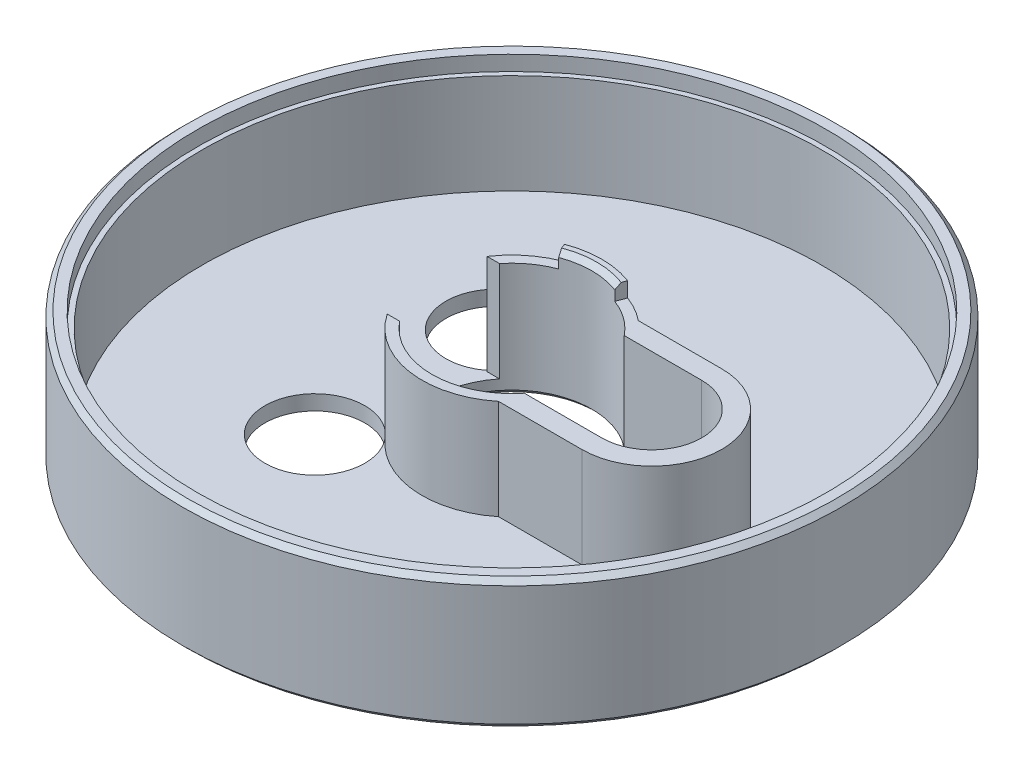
ISO-10303-21;
HEADER;
FILE_DESCRIPTION(('STEP AP214'),'2;1');
FILE_NAME('part.step','',(''),(''),'','','');
FILE_SCHEMA(('AUTOMOTIVE_DESIGN { 1 0 10303 214 1 1 1 1 }'));
ENDSEC;
DATA;
#1=APPLICATION_CONTEXT('core data for automotive mechanical design processes');
#2=APPLICATION_PROTOCOL_DEFINITION('international standard','automotive_design',2000,#1);
#3=PRODUCT_CONTEXT('',#1,'mechanical');
#4=PRODUCT('Part','Part','',(#3));
#5=PRODUCT_RELATED_PRODUCT_CATEGORY('part','',(#4));
#6=PRODUCT_DEFINITION_FORMATION('','',#4);
#7=PRODUCT_DEFINITION_CONTEXT('part definition',#1,'design');
#8=PRODUCT_DEFINITION('design','',#6,#7);
#9=PRODUCT_DEFINITION_SHAPE('','',#8);
#10=(LENGTH_UNIT() NAMED_UNIT(*) SI_UNIT(.MILLI.,.METRE.));
#11=(NAMED_UNIT(*) PLANE_ANGLE_UNIT() SI_UNIT($,.RADIAN.));
#12=(NAMED_UNIT(*) SI_UNIT($,.STERADIAN.) SOLID_ANGLE_UNIT());
#13=UNCERTAINTY_MEASURE_WITH_UNIT(LENGTH_MEASURE(1.E-05),#10,'distance_accuracy_value','');
#14=(GEOMETRIC_REPRESENTATION_CONTEXT(3) GLOBAL_UNCERTAINTY_ASSIGNED_CONTEXT((#13)) GLOBAL_UNIT_ASSIGNED_CONTEXT((#10,
#11,#12)) REPRESENTATION_CONTEXT('',''));
#15=CARTESIAN_POINT('',(0.,0.,0.));
#16=DIRECTION('',(0.,0.,1.));
#17=DIRECTION('',(1.,0.,0.));
#18=AXIS2_PLACEMENT_3D('',#15,#16,#17);
#19=CARTESIAN_POINT('',(0.,-1.5,0.));
#20=DIRECTION('',(0.,1.,0.));
#21=DIRECTION('',(0.,0.,1.));
#22=AXIS2_PLACEMENT_3D('',#19,#20,#21);
#23=PLANE('',#22);
#24=DIRECTION('',(0.351123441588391,0.,0.936329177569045));
#25=VECTOR('',#24,1.);
#26=CARTESIAN_POINT('',(-3.,-1.5,-8.));
#27=LINE('',#26,#25);
#28=CARTESIAN_POINT('',(-3.16011097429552,-1.5,-8.4269625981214));
#29=VERTEX_POINT('',#28);
#30=CARTESIAN_POINT('',(-2.80898753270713,-1.5,-7.49063342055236));
#31=VERTEX_POINT('',#30);
#32=EDGE_CURVE('E264',#29,#31,#27,.T.);
#33=ORIENTED_EDGE('',*,*,#32,.F.);
#34=CARTESIAN_POINT('',(0.,-1.5,0.));
#35=DIRECTION('',(0.,1.,0.));
#36=DIRECTION('',(0.,0.,1.));
#37=AXIS2_PLACEMENT_3D('',#34,#35,#36);
#38=CIRCLE('',#37,9.);
#39=CARTESIAN_POINT('',(-7.48331477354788,-1.5,-5.));
#40=VERTEX_POINT('',#39);
#41=EDGE_CURVE('E206',#29,#40,#38,.T.);
#42=ORIENTED_EDGE('',*,*,#41,.T.);
#43=DIRECTION('',(-1.,0.,0.));
#44=VECTOR('',#43,1.);
#45=CARTESIAN_POINT('',(0.,-1.5,-5.));
#46=LINE('',#45,#44);
#47=CARTESIAN_POINT('',(-6.2449979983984,-1.5,-5.));
#48=VERTEX_POINT('',#47);
#49=EDGE_CURVE('E322',#48,#40,#46,.T.);
#50=ORIENTED_EDGE('',*,*,#49,.F.);
#51=CARTESIAN_POINT('',(0.,-1.5,0.));
#52=DIRECTION('',(0.,1.,0.));
#53=DIRECTION('',(0.,0.,1.));
#54=AXIS2_PLACEMENT_3D('',#51,#52,#53);
#55=CIRCLE('',#54,8.);
#56=EDGE_CURVE('E268',#31,#48,#55,.T.);
#57=ORIENTED_EDGE('',*,*,#56,.F.);
#58=EDGE_LOOP('',(#33,#42,#50,#57));
#59=FACE_BOUND('',#58,.T.);
#60=ADVANCED_FACE('F32',(#59),#23,.T.);
#61=DIRECTION('',(1.,0.,0.));
#62=VECTOR('',#61,1.);
#63=CARTESIAN_POINT('',(14.,-1.5,5.));
#64=LINE('',#63,#62);
#65=CARTESIAN_POINT('',(-7.48331477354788,-1.5,5.));
#66=VERTEX_POINT('',#65);
#67=CARTESIAN_POINT('',(-6.2449979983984,-1.5,5.));
#68=VERTEX_POINT('',#67);
#69=EDGE_CURVE('E225',#66,#68,#64,.T.);
#70=ORIENTED_EDGE('',*,*,#69,.F.);
#71=CARTESIAN_POINT('',(5.65685424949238,-1.5,7.));
#72=VERTEX_POINT('',#71);
#73=EDGE_CURVE('E202',#66,#72,#38,.T.);
#74=ORIENTED_EDGE('',*,*,#73,.T.);
#75=DIRECTION('',(1.,0.,0.));
#76=VECTOR('',#75,1.);
#77=CARTESIAN_POINT('',(14.,-1.5,7.));
#78=LINE('',#77,#76);
#79=CARTESIAN_POINT('',(14.,-1.5,7.));
#80=VERTEX_POINT('',#79);
#81=EDGE_CURVE('E205',#72,#80,#78,.T.);
#82=ORIENTED_EDGE('',*,*,#81,.T.);
#83=CARTESIAN_POINT('',(14.,-1.5,0.));
#84=DIRECTION('',(0.,1.,0.));
#85=DIRECTION('',(0.,0.,1.));
#86=AXIS2_PLACEMENT_3D('',#83,#84,#85);
#87=CIRCLE('',#86,7.);
#88=CARTESIAN_POINT('',(14.,-1.5,-7.));
#89=VERTEX_POINT('',#88);
#90=EDGE_CURVE('E178',#80,#89,#87,.T.);
#91=ORIENTED_EDGE('',*,*,#90,.T.);
#92=DIRECTION('',(-1.,0.,0.));
#93=VECTOR('',#92,1.);
#94=CARTESIAN_POINT('',(14.,-1.5,-7.));
#95=LINE('',#94,#93);
#96=CARTESIAN_POINT('',(5.65685424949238,-1.5,-7.));
#97=VERTEX_POINT('',#96);
#98=EDGE_CURVE('E199',#89,#97,#95,.T.);
#99=ORIENTED_EDGE('',*,*,#98,.T.);
#100=CARTESIAN_POINT('',(3.16011097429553,-1.5,-8.4269625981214));
#101=VERTEX_POINT('',#100);
#102=EDGE_CURVE('E203',#97,#101,#38,.T.);
#103=ORIENTED_EDGE('',*,*,#102,.T.);
#104=DIRECTION('',(0.351123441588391,0.,-0.936329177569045));
#105=VECTOR('',#104,1.);
#106=CARTESIAN_POINT('',(3.,-1.5,-8.));
#107=LINE('',#106,#105);
#108=CARTESIAN_POINT('',(2.80898753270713,-1.5,-7.49063342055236));
#109=VERTEX_POINT('',#108);
#110=EDGE_CURVE('E261',#109,#101,#107,.T.);
#111=ORIENTED_EDGE('',*,*,#110,.F.);
#112=CARTESIAN_POINT('',(6.2449979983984,-1.5,-5.));
#113=VERTEX_POINT('',#112);
#114=EDGE_CURVE('E267',#113,#109,#55,.T.);
#115=ORIENTED_EDGE('',*,*,#114,.F.);
#116=DIRECTION('',(-1.,0.,0.));
#117=VECTOR('',#116,1.);
#118=CARTESIAN_POINT('',(14.,-1.5,-5.));
#119=LINE('',#118,#117);
#120=CARTESIAN_POINT('',(14.,-1.5,-5.));
#121=VERTEX_POINT('',#120);
#122=EDGE_CURVE('E235',#121,#113,#119,.T.);
#123=ORIENTED_EDGE('',*,*,#122,.F.);
#124=CARTESIAN_POINT('',(14.,-1.5,0.));
#125=DIRECTION('',(0.,1.,0.));
#126=DIRECTION('',(0.,0.,1.));
#127=AXIS2_PLACEMENT_3D('',#124,#125,#126);
#128=CIRCLE('',#127,5.);
#129=CARTESIAN_POINT('',(14.,-1.5,5.));
#130=VERTEX_POINT('',#129);
#131=EDGE_CURVE('E218',#130,#121,#128,.T.);
#132=ORIENTED_EDGE('',*,*,#131,.F.);
#133=DIRECTION('',(1.,0.,0.));
#134=VECTOR('',#133,1.);
#135=CARTESIAN_POINT('',(0.,-1.5,5.));
#136=LINE('',#135,#134);
#137=CARTESIAN_POINT('',(6.2449979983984,-1.5,5.));
#138=VERTEX_POINT('',#137);
#139=EDGE_CURVE('E324',#138,#130,#136,.T.);
#140=ORIENTED_EDGE('',*,*,#139,.F.);
#141=EDGE_CURVE('E272',#68,#138,#55,.T.);
#142=ORIENTED_EDGE('',*,*,#141,.F.);
#143=EDGE_LOOP('',(#70,#74,#82,#91,#99,#103,#111,#115,#123,#132,#140,#142));
#144=FACE_BOUND('',#143,.T.);
#145=ADVANCED_FACE('F348',(#144),#23,.T.);
#146=CARTESIAN_POINT('',(0.,0.,0.));
#147=DIRECTION('',(0.,1.,0.));
#148=DIRECTION('',(0.,0.,1.));
#149=AXIS2_PLACEMENT_3D('',#146,#147,#148);
#150=PLANE('',#149);
#151=DIRECTION('',(0.351123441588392,0.,0.936329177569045));
#152=VECTOR('',#151,1.);
#153=CARTESIAN_POINT('',(-2.80898753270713,0.,-7.49063342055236));
#154=LINE('',#153,#152);
#155=CARTESIAN_POINT('',(-3.16011097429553,0.,-8.4269625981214));
#156=VERTEX_POINT('',#155);
#157=CARTESIAN_POINT('',(-2.98454925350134,0.,-7.95879800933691));
#158=VERTEX_POINT('',#157);
#159=EDGE_CURVE('E275',#156,#158,#154,.T.);
#160=ORIENTED_EDGE('',*,*,#159,.T.);
#161=CARTESIAN_POINT('',(0.,0.,0.));
#162=DIRECTION('',(0.,1.,0.));
#163=DIRECTION('',(0.,0.,1.));
#164=AXIS2_PLACEMENT_3D('',#161,#162,#163);
#165=CIRCLE('',#164,8.50000000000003);
#166=CARTESIAN_POINT('',(2.98454925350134,0.,-7.95879800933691));
#167=VERTEX_POINT('',#166);
#168=EDGE_CURVE('E303',#158,#167,#165,.F.);
#169=ORIENTED_EDGE('',*,*,#168,.T.);
#170=DIRECTION('',(0.351123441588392,0.,-0.936329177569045));
#171=VECTOR('',#170,1.);
#172=CARTESIAN_POINT('',(2.80898753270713,0.,-7.49063342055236));
#173=LINE('',#172,#171);
#174=CARTESIAN_POINT('',(3.16011097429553,0.,-8.4269625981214));
#175=VERTEX_POINT('',#174);
#176=EDGE_CURVE('E265',#167,#175,#173,.T.);
#177=ORIENTED_EDGE('',*,*,#176,.T.);
#178=CARTESIAN_POINT('',(0.,0.,0.));
#179=DIRECTION('',(0.,1.,0.));
#180=DIRECTION('',(0.,0.,1.));
#181=AXIS2_PLACEMENT_3D('',#178,#179,#180);
#182=CIRCLE('',#181,9.);
#183=EDGE_CURVE('E260',#175,#156,#182,.T.);
#184=ORIENTED_EDGE('',*,*,#183,.T.);
#185=EDGE_LOOP('',(#160,#169,#177,#184));
#186=FACE_BOUND('',#185,.T.);
#187=ADVANCED_FACE('F399',(#186),#150,.T.);
#188=CARTESIAN_POINT('',(0.,-13.,0.));
#189=DIRECTION('',(0.,1.,0.));
#190=DIRECTION('',(0.,0.,1.));
#191=AXIS2_PLACEMENT_3D('',#188,#189,#190);
#192=CYLINDRICAL_SURFACE('',#191,8.);
#193=CARTESIAN_POINT('',(0.,-11.5,0.));
#194=DIRECTION('',(0.,1.,0.));
#195=DIRECTION('',(0.,0.,1.));
#196=AXIS2_PLACEMENT_3D('',#193,#194,#195);
#197=CIRCLE('',#196,8.);
#198=CARTESIAN_POINT('',(-6.2449979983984,-11.5,5.));
#199=VERTEX_POINT('',#198);
#200=CARTESIAN_POINT('',(-6.2449979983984,-11.5,-5.));
#201=VERTEX_POINT('',#200);
#202=EDGE_CURVE('E11',#199,#201,#197,.F.);
#203=ORIENTED_EDGE('',*,*,#202,.F.);
#204=DIRECTION('',(0.,1.,0.));
#205=VECTOR('',#204,1.);
#206=CARTESIAN_POINT('',(-6.2449979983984,-13.,5.));
#207=LINE('',#206,#205);
#208=EDGE_CURVE('E254',#199,#68,#207,.T.);
#209=ORIENTED_EDGE('',*,*,#208,.T.);
#210=ORIENTED_EDGE('',*,*,#141,.T.);
#211=DIRECTION('',(0.,1.,0.));
#212=VECTOR('',#211,1.);
#213=CARTESIAN_POINT('',(6.2449979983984,-13.,5.));
#214=LINE('',#213,#212);
#215=CARTESIAN_POINT('',(6.2449979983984,-11.5,5.));
#216=VERTEX_POINT('',#215);
#217=EDGE_CURVE('E257',#138,#216,#214,.F.);
#218=ORIENTED_EDGE('',*,*,#217,.T.);
#219=CARTESIAN_POINT('',(6.2449979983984,-11.5,-5.));
#220=VERTEX_POINT('',#219);
#221=EDGE_CURVE('E36',#220,#216,#197,.F.);
#222=ORIENTED_EDGE('',*,*,#221,.F.);
#223=DIRECTION('',(0.,1.,0.));
#224=VECTOR('',#223,1.);
#225=CARTESIAN_POINT('',(6.2449979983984,-13.,-5.));
#226=LINE('',#225,#224);
#227=EDGE_CURVE('E241',#220,#113,#226,.T.);
#228=ORIENTED_EDGE('',*,*,#227,.T.);
#229=ORIENTED_EDGE('',*,*,#114,.T.);
#230=DIRECTION('',(0.,1.,0.));
#231=VECTOR('',#230,1.);
#232=CARTESIAN_POINT('',(2.80898753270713,-1.5,-7.49063342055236));
#233=LINE('',#232,#231);
#234=CARTESIAN_POINT('',(2.80898753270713,-0.500000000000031,-7.49063342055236));
#235=VERTEX_POINT('',#234);
#236=EDGE_CURVE('E279',#109,#235,#233,.T.);
#237=ORIENTED_EDGE('',*,*,#236,.T.);
#238=CARTESIAN_POINT('',(0.,-0.500000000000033,0.));
#239=DIRECTION('',(0.,1.,0.));
#240=DIRECTION('',(0.,0.,1.));
#241=AXIS2_PLACEMENT_3D('',#238,#239,#240);
#242=CIRCLE('',#241,8.);
#243=CARTESIAN_POINT('',(-2.80898753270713,-0.500000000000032,-7.49063342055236));
#244=VERTEX_POINT('',#243);
#245=EDGE_CURVE('E298',#235,#244,#242,.T.);
#246=ORIENTED_EDGE('',*,*,#245,.T.);
#247=DIRECTION('',(0.,1.,0.));
#248=VECTOR('',#247,1.);
#249=CARTESIAN_POINT('',(-2.80898753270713,-1.5,-7.49063342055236));
#250=LINE('',#249,#248);
#251=EDGE_CURVE('E283',#31,#244,#250,.T.);
#252=ORIENTED_EDGE('',*,*,#251,.F.);
#253=ORIENTED_EDGE('',*,*,#56,.T.);
#254=DIRECTION('',(0.,1.,0.));
#255=VECTOR('',#254,1.);
#256=CARTESIAN_POINT('',(-6.2449979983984,-13.,-5.));
#257=LINE('',#256,#255);
#258=EDGE_CURVE('E251',#48,#201,#257,.F.);
#259=ORIENTED_EDGE('',*,*,#258,.T.);
#260=EDGE_LOOP('',(#203,#209,#210,#218,#222,#228,#229,#237,#246,#252,#253,#259));
#261=FACE_BOUND('',#260,.T.);
#262=CARTESIAN_POINT('',(0.,-12.5,0.));
#263=DIRECTION('',(0.,1.,0.));
#264=DIRECTION('',(0.,0.,1.));
#265=AXIS2_PLACEMENT_3D('',#262,#263,#264);
#266=CIRCLE('',#265,8.);
#267=CARTESIAN_POINT('',(0.,-12.5,8.));
#268=VERTEX_POINT('',#267);
#269=EDGE_CURVE('E293',#268,#268,#266,.F.);
#270=ORIENTED_EDGE('',*,*,#269,.T.);
#271=EDGE_LOOP('',(#270));
#272=FACE_BOUND('',#271,.T.);
#273=ADVANCED_FACE('F338',(#261,#272),#192,.F.);
#274=CARTESIAN_POINT('',(0.,-13.,0.));
#275=DIRECTION('',(0.,1.,0.));
#276=DIRECTION('',(0.,0.,1.));
#277=AXIS2_PLACEMENT_3D('',#274,#275,#276);
#278=CYLINDRICAL_SURFACE('',#277,33.);
#279=CARTESIAN_POINT('',(0.,-12.5,0.));
#280=DIRECTION('',(0.,1.,0.));
#281=DIRECTION('',(0.,0.,1.));
#282=AXIS2_PLACEMENT_3D('',#279,#280,#281);
#283=CIRCLE('',#282,33.);
#284=CARTESIAN_POINT('',(0.,-12.5,33.));
#285=VERTEX_POINT('',#284);
#286=EDGE_CURVE('E316',#285,#285,#283,.T.);
#287=CARTESIAN_POINT('',(0.,-0.499999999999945,0.));
#288=DIRECTION('',(0.,1.,0.));
#289=DIRECTION('',(0.,0.,1.));
#290=AXIS2_PLACEMENT_3D('',#287,#288,#289);
#291=CIRCLE('',#290,33.);
#292=CARTESIAN_POINT('',(0.,-0.499999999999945,33.));
#293=VERTEX_POINT('',#292);
#294=EDGE_CURVE('E313',#293,#293,#291,.F.);
#295=CARTESIAN_POINT('',(0.,-12.5,33.));
#296=CARTESIAN_POINT('',(0.,-12.375,33.));
#297=CARTESIAN_POINT('',(0.,-12.25,33.));
#298=CARTESIAN_POINT('',(0.,-12.,33.));
#299=CARTESIAN_POINT('',(0.,-11.875,33.));
#300=CARTESIAN_POINT('',(0.,-11.625,33.));
#301=CARTESIAN_POINT('',(0.,-11.5,33.));
#302=CARTESIAN_POINT('',(0.,-11.25,33.));
#303=CARTESIAN_POINT('',(0.,-11.125,33.));
#304=CARTESIAN_POINT('',(0.,-10.875,33.));
#305=CARTESIAN_POINT('',(0.,-10.75,33.));
#306=CARTESIAN_POINT('',(0.,-10.5,33.));
#307=CARTESIAN_POINT('',(0.,-10.375,33.));
#308=CARTESIAN_POINT('',(0.,-10.125,33.));
#309=CARTESIAN_POINT('',(0.,-9.99999999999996,33.));
#310=CARTESIAN_POINT('',(0.,-9.74999999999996,33.));
#311=CARTESIAN_POINT('',(0.,-9.62499999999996,33.));
#312=CARTESIAN_POINT('',(0.,-9.37499999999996,33.));
#313=CARTESIAN_POINT('',(0.,-9.24999999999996,33.));
#314=CARTESIAN_POINT('',(0.,-8.99999999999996,33.));
#315=CARTESIAN_POINT('',(0.,-8.87499999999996,33.));
#316=CARTESIAN_POINT('',(0.,-8.62499999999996,33.));
#317=CARTESIAN_POINT('',(0.,-8.49999999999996,33.));
#318=CARTESIAN_POINT('',(0.,-8.24999999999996,33.));
#319=CARTESIAN_POINT('',(0.,-8.12499999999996,33.));
#320=CARTESIAN_POINT('',(0.,-7.87499999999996,33.));
#321=CARTESIAN_POINT('',(0.,-7.74999999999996,33.));
#322=CARTESIAN_POINT('',(0.,-7.49999999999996,33.));
#323=CARTESIAN_POINT('',(0.,-7.37499999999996,33.));
#324=CARTESIAN_POINT('',(0.,-7.12499999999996,33.));
#325=CARTESIAN_POINT('',(0.,-6.99999999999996,33.));
#326=CARTESIAN_POINT('',(0.,-6.74999999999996,33.));
#327=CARTESIAN_POINT('',(0.,-6.62499999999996,33.));
#328=CARTESIAN_POINT('',(0.,-6.37499999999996,33.));
#329=CARTESIAN_POINT('',(0.,-6.24999999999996,33.));
#330=CARTESIAN_POINT('',(0.,-5.99999999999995,33.));
#331=CARTESIAN_POINT('',(0.,-5.87499999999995,33.));
#332=CARTESIAN_POINT('',(0.,-5.62499999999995,33.));
#333=CARTESIAN_POINT('',(0.,-5.49999999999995,33.));
#334=CARTESIAN_POINT('',(0.,-5.24999999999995,33.));
#335=CARTESIAN_POINT('',(0.,-5.12499999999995,33.));
#336=CARTESIAN_POINT('',(0.,-4.87499999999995,33.));
#337=CARTESIAN_POINT('',(0.,-4.74999999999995,33.));
#338=CARTESIAN_POINT('',(0.,-4.49999999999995,33.));
#339=CARTESIAN_POINT('',(0.,-4.37499999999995,33.));
#340=CARTESIAN_POINT('',(0.,-4.12499999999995,33.));
#341=CARTESIAN_POINT('',(0.,-3.99999999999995,33.));
#342=CARTESIAN_POINT('',(0.,-3.74999999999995,33.));
#343=CARTESIAN_POINT('',(0.,-3.62499999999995,33.));
#344=CARTESIAN_POINT('',(0.,-3.37499999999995,33.));
#345=CARTESIAN_POINT('',(0.,-3.24999999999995,33.));
#346=CARTESIAN_POINT('',(0.,-2.99999999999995,33.));
#347=CARTESIAN_POINT('',(0.,-2.87499999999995,33.));
#348=CARTESIAN_POINT('',(0.,-2.62499999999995,33.));
#349=CARTESIAN_POINT('',(0.,-2.49999999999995,33.));
#350=CARTESIAN_POINT('',(0.,-2.24999999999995,33.));
#351=CARTESIAN_POINT('',(0.,-2.12499999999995,33.));
#352=CARTESIAN_POINT('',(0.,-1.87499999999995,33.));
#353=CARTESIAN_POINT('',(0.,-1.74999999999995,33.));
#354=CARTESIAN_POINT('',(0.,-1.49999999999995,33.));
#355=CARTESIAN_POINT('',(0.,-1.37499999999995,33.));
#356=CARTESIAN_POINT('',(0.,-1.12499999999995,33.));
#357=CARTESIAN_POINT('',(0.,-0.999999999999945,33.));
#358=CARTESIAN_POINT('',(0.,-0.749999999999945,33.));
#359=CARTESIAN_POINT('',(0.,-0.624999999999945,33.));
#360=CARTESIAN_POINT('',(0.,-0.499999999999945,33.));
#361=B_SPLINE_CURVE_WITH_KNOTS('',3,(#295,#296,#297,#298,#299,#300,#301,#302,#303,#304,#305,
#306,#307,#308,#309,#310,#311,#312,#313,#314,#315,#316,#317,#318,#319,#320,#321,#322,#323,#324,
#325,#326,#327,#328,#329,#330,#331,#332,#333,#334,#335,#336,#337,#338,#339,#340,#341,#342,#343,
#344,#345,#346,#347,#348,#349,#350,#351,#352,#353,#354,#355,#356,#357,#358,#359,#360),
.UNSPECIFIED.,.F.,.F.,(4,2,2,2,2,2,2,2,2,2,2,2,2,2,2,2,2,2,2,2,2,2,2,2,2,2,2,2,2,2,2,2,4),(0.,
0.375,0.750000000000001,1.125,1.5,1.875,2.25,2.625,3.,3.375,3.75,4.12500000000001,
4.50000000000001,4.87500000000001,5.25000000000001,5.62500000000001,6.00000000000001,
6.37500000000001,6.75000000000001,7.12500000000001,7.50000000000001,7.87500000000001,
8.25000000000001,8.62500000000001,9.00000000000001,9.37500000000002,9.75000000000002,10.125,
10.5,10.875,11.25,11.625,12.),.UNSPECIFIED.);
#362=EDGE_CURVE('BSEAM407',#285,#293,#361,.T.);
#363=ORIENTED_EDGE('',*,*,#286,.T.);
#364=ORIENTED_EDGE('',*,*,#294,.T.);
#365=ORIENTED_EDGE('',*,*,#362,.T.);
#366=ORIENTED_EDGE('',*,*,#362,.F.);
#367=EDGE_LOOP('',(#363,#365,#364,#366));
#368=FACE_BOUND('',#367,.T.);
#369=ADVANCED_FACE('F407',(#368),#278,.T.);
#370=CARTESIAN_POINT('',(0.,-13.,0.));
#371=DIRECTION('',(0.,1.,0.));
#372=DIRECTION('',(0.,0.,1.));
#373=AXIS2_PLACEMENT_3D('',#370,#371,#372);
#374=PLANE('',#373);
#375=CARTESIAN_POINT('',(-10.669290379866,-13.,9.06455971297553));
#376=DIRECTION('',(0.,1.,0.));
#377=DIRECTION('',(0.,0.,1.));
#378=AXIS2_PLACEMENT_3D('',#375,#376,#377);
#379=CIRCLE('',#378,5.);
#380=CARTESIAN_POINT('',(-10.669290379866,-13.,14.0645597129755));
#381=VERTEX_POINT('',#380);
#382=EDGE_CURVE('E497',#381,#381,#379,.T.);
#383=ORIENTED_EDGE('',*,*,#382,.T.);
#384=EDGE_LOOP('',(#383));
#385=FACE_BOUND('',#384,.T.);
#386=CARTESIAN_POINT('',(-10.669290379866,-13.,-9.06455971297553));
#387=DIRECTION('',(0.,1.,0.));
#388=DIRECTION('',(0.,0.,1.));
#389=AXIS2_PLACEMENT_3D('',#386,#387,#388);
#390=CIRCLE('',#389,5.);
#391=CARTESIAN_POINT('',(-10.669290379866,-13.,-4.06455971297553));
#392=VERTEX_POINT('',#391);
#393=EDGE_CURVE('E167',#392,#392,#390,.T.);
#394=ORIENTED_EDGE('',*,*,#393,.T.);
#395=EDGE_LOOP('',(#394));
#396=FACE_BOUND('',#395,.T.);
#397=CARTESIAN_POINT('',(26.,-13.,0.));
#398=DIRECTION('',(0.,1.,0.));
#399=DIRECTION('',(0.,0.,1.));
#400=AXIS2_PLACEMENT_3D('',#397,#398,#399);
#401=CIRCLE('',#400,5.);
#402=CARTESIAN_POINT('',(26.,-13.,5.));
#403=VERTEX_POINT('',#402);
#404=EDGE_CURVE('E176',#403,#403,#401,.T.);
#405=ORIENTED_EDGE('',*,*,#404,.T.);
#406=EDGE_LOOP('',(#405));
#407=FACE_BOUND('',#406,.T.);
#408=CARTESIAN_POINT('',(0.,-13.,0.));
#409=DIRECTION('',(0.,1.,0.));
#410=DIRECTION('',(0.,0.,1.));
#411=AXIS2_PLACEMENT_3D('',#408,#409,#410);
#412=CIRCLE('',#411,8.49999999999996);
#413=CARTESIAN_POINT('',(0.,-13.,8.49999999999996));
#414=VERTEX_POINT('',#413);
#415=EDGE_CURVE('E310',#414,#414,#412,.T.);
#416=ORIENTED_EDGE('',*,*,#415,.T.);
#417=EDGE_LOOP('',(#416));
#418=FACE_BOUND('',#417,.T.);
#419=CARTESIAN_POINT('',(0.,-13.,0.));
#420=DIRECTION('',(0.,1.,0.));
#421=DIRECTION('',(0.,0.,1.));
#422=AXIS2_PLACEMENT_3D('',#419,#420,#421);
#423=CIRCLE('',#422,32.5);
#424=CARTESIAN_POINT('',(0.,-13.,32.5));
#425=VERTEX_POINT('',#424);
#426=EDGE_CURVE('E307',#425,#425,#423,.F.);
#427=ORIENTED_EDGE('',*,*,#426,.T.);
#428=EDGE_LOOP('',(#427));
#429=FACE_BOUND('',#428,.T.);
#430=ADVANCED_FACE('F415',(#385,#396,#407,#418,#429),#374,.F.);
#431=CARTESIAN_POINT('',(0.,0.,0.));
#432=DIRECTION('',(0.,1.,0.));
#433=DIRECTION('',(0.,0.,1.));
#434=AXIS2_PLACEMENT_3D('',#431,#432,#433);
#435=CIRCLE('',#434,32.5);
#436=CARTESIAN_POINT('',(0.,0.,32.5));
#437=VERTEX_POINT('',#436);
#438=EDGE_CURVE('E319',#437,#437,#435,.T.);
#439=ORIENTED_EDGE('',*,*,#438,.T.);
#440=EDGE_LOOP('',(#439));
#441=FACE_BOUND('',#440,.T.);
#442=CARTESIAN_POINT('',(0.,0.,0.));
#443=DIRECTION('',(0.,1.,0.));
#444=DIRECTION('',(0.,0.,1.));
#445=AXIS2_PLACEMENT_3D('',#442,#443,#444);
#446=CIRCLE('',#445,31.5);
#447=CARTESIAN_POINT('',(0.,0.,31.5));
#448=VERTEX_POINT('',#447);
#449=EDGE_CURVE('E282',#448,#448,#446,.T.);
#450=ORIENTED_EDGE('',*,*,#449,.F.);
#451=EDGE_LOOP('',(#450));
#452=FACE_BOUND('',#451,.T.);
#453=ADVANCED_FACE('F402',(#441,#452),#150,.T.);
#454=CARTESIAN_POINT('',(0.,-1.5,0.));
#455=DIRECTION('',(0.,1.,0.));
#456=DIRECTION('',(0.,0.,1.));
#457=AXIS2_PLACEMENT_3D('',#454,#455,#456);
#458=CYLINDRICAL_SURFACE('',#457,31.5);
#459=CARTESIAN_POINT('',(0.,-1.5,0.));
#460=DIRECTION('',(0.,1.,0.));
#461=DIRECTION('',(0.,0.,1.));
#462=AXIS2_PLACEMENT_3D('',#459,#460,#461);
#463=CIRCLE('',#462,31.5);
#464=CARTESIAN_POINT('',(0.,-1.5,31.5));
#465=VERTEX_POINT('',#464);
#466=EDGE_CURVE('E290',#465,#465,#463,.T.);
#467=ORIENTED_EDGE('',*,*,#466,.F.);
#468=EDGE_LOOP('',(#467));
#469=FACE_BOUND('',#468,.T.);
#470=ORIENTED_EDGE('',*,*,#449,.T.);
#471=EDGE_LOOP('',(#470));
#472=FACE_BOUND('',#471,.T.);
#473=ADVANCED_FACE('F414',(#469,#472),#458,.F.);
#474=CARTESIAN_POINT('',(0.,-1.5,0.));
#475=DIRECTION('',(0.,1.,0.));
#476=DIRECTION('',(0.,0.,1.));
#477=AXIS2_PLACEMENT_3D('',#474,#475,#476);
#478=CIRCLE('',#477,31.);
#479=CARTESIAN_POINT('',(0.,-1.5,31.));
#480=VERTEX_POINT('',#479);
#481=EDGE_CURVE('E211',#480,#480,#478,.T.);
#482=ORIENTED_EDGE('',*,*,#481,.F.);
#483=EDGE_LOOP('',(#482));
#484=FACE_BOUND('',#483,.T.);
#485=ORIENTED_EDGE('',*,*,#466,.T.);
#486=EDGE_LOOP('',(#485));
#487=FACE_BOUND('',#486,.T.);
#488=ADVANCED_FACE('F410',(#484,#487),#23,.T.);
#489=CARTESIAN_POINT('',(2.80898753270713,-1.5,-7.49063342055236));
#490=DIRECTION('',(0.936329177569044,0.,0.351123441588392));
#491=DIRECTION('',(0.351123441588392,0.,-0.936329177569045));
#492=AXIS2_PLACEMENT_3D('',#489,#490,#491);
#493=PLANE('',#492);
#494=ORIENTED_EDGE('',*,*,#176,.F.);
#495=DIRECTION('',(0.24828176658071,0.707106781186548,-0.662084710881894));
#496=VECTOR('',#495,1.);
#497=CARTESIAN_POINT('',(0.,-8.50000000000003,0.));
#498=LINE('',#497,#496);
#499=EDGE_CURVE('E305',#167,#235,#498,.F.);
#500=ORIENTED_EDGE('',*,*,#499,.T.);
#501=ORIENTED_EDGE('',*,*,#236,.F.);
#502=ORIENTED_EDGE('',*,*,#110,.T.);
#503=DIRECTION('',(0.,1.,0.));
#504=VECTOR('',#503,1.);
#505=CARTESIAN_POINT('',(3.16011097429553,-1.5,-8.4269625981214));
#506=LINE('',#505,#504);
#507=EDGE_CURVE('E271',#101,#175,#506,.T.);
#508=ORIENTED_EDGE('',*,*,#507,.T.);
#509=EDGE_LOOP('',(#494,#500,#501,#502,#508));
#510=FACE_BOUND('',#509,.T.);
#511=ADVANCED_FACE('F353',(#510),#493,.T.);
#512=CARTESIAN_POINT('',(-2.80898753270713,-1.5,-7.49063342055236));
#513=DIRECTION('',(-0.936329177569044,0.,0.351123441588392));
#514=DIRECTION('',(0.351123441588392,0.,0.936329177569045));
#515=AXIS2_PLACEMENT_3D('',#512,#513,#514);
#516=PLANE('',#515);
#517=ORIENTED_EDGE('',*,*,#251,.T.);
#518=DIRECTION('',(0.24828176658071,-0.707106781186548,0.662084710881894));
#519=VECTOR('',#518,1.);
#520=CARTESIAN_POINT('',(0.,-8.50000000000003,0.));
#521=LINE('',#520,#519);
#522=EDGE_CURVE('E301',#244,#158,#521,.F.);
#523=ORIENTED_EDGE('',*,*,#522,.T.);
#524=ORIENTED_EDGE('',*,*,#159,.F.);
#525=DIRECTION('',(0.,1.,0.));
#526=VECTOR('',#525,1.);
#527=CARTESIAN_POINT('',(-3.16011097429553,-1.5,-8.4269625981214));
#528=LINE('',#527,#526);
#529=EDGE_CURVE('E286',#29,#156,#528,.T.);
#530=ORIENTED_EDGE('',*,*,#529,.F.);
#531=ORIENTED_EDGE('',*,*,#32,.T.);
#532=EDGE_LOOP('',(#517,#523,#524,#530,#531));
#533=FACE_BOUND('',#532,.T.);
#534=ADVANCED_FACE('F360',(#533),#516,.T.);
#535=CARTESIAN_POINT('',(0.,-1.5,0.));
#536=DIRECTION('',(0.,1.,0.));
#537=DIRECTION('',(0.,0.,1.));
#538=AXIS2_PLACEMENT_3D('',#535,#536,#537);
#539=CYLINDRICAL_SURFACE('',#538,9.);
#540=ORIENTED_EDGE('',*,*,#183,.F.);
#541=ORIENTED_EDGE('',*,*,#507,.F.);
#542=ORIENTED_EDGE('',*,*,#102,.F.);
#543=DIRECTION('',(0.,1.,0.));
#544=VECTOR('',#543,1.);
#545=CARTESIAN_POINT('',(5.65685424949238,-11.5,-7.));
#546=LINE('',#545,#544);
#547=CARTESIAN_POINT('',(5.65685424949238,-11.5,-7.));
#548=VERTEX_POINT('',#547);
#549=EDGE_CURVE('E214',#548,#97,#546,.T.);
#550=ORIENTED_EDGE('',*,*,#549,.F.);
#551=CARTESIAN_POINT('',(0.,-11.5,0.));
#552=DIRECTION('',(0.,1.,0.));
#553=DIRECTION('',(0.,0.,1.));
#554=AXIS2_PLACEMENT_3D('',#551,#552,#553);
#555=CIRCLE('',#554,9.);
#556=CARTESIAN_POINT('',(-6.85882952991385,-11.5,-5.82721695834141));
#557=VERTEX_POINT('',#556);
#558=EDGE_CURVE('E188',#548,#557,#555,.T.);
#559=ORIENTED_EDGE('',*,*,#558,.T.);
#560=CARTESIAN_POINT('',(-7.48331477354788,-11.5,-5.));
#561=VERTEX_POINT('',#560);
#562=EDGE_CURVE('E192',#557,#561,#555,.T.);
#563=ORIENTED_EDGE('',*,*,#562,.T.);
#564=DIRECTION('',(0.,1.,0.));
#565=VECTOR('',#564,1.);
#566=CARTESIAN_POINT('',(-7.48331477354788,-11.5,-5.));
#567=LINE('',#566,#565);
#568=EDGE_CURVE('E245',#561,#40,#567,.T.);
#569=ORIENTED_EDGE('',*,*,#568,.T.);
#570=ORIENTED_EDGE('',*,*,#41,.F.);
#571=ORIENTED_EDGE('',*,*,#529,.T.);
#572=EDGE_LOOP('',(#540,#541,#542,#550,#559,#563,#569,#570,#571));
#573=FACE_BOUND('',#572,.T.);
#574=ADVANCED_FACE('F384',(#573),#539,.T.);
#575=CARTESIAN_POINT('',(0.,-0.500000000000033,0.));
#576=DIRECTION('',(0.,1.,0.));
#577=DIRECTION('',(0.,0.,1.));
#578=AXIS2_PLACEMENT_3D('',#575,#576,#577);
#579=CONICAL_SURFACE('',#578,8.,0.785398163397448);
#580=ORIENTED_EDGE('',*,*,#499,.F.);
#581=ORIENTED_EDGE('',*,*,#168,.F.);
#582=ORIENTED_EDGE('',*,*,#522,.F.);
#583=ORIENTED_EDGE('',*,*,#245,.F.);
#584=EDGE_LOOP('',(#580,#581,#582,#583));
#585=FACE_BOUND('',#584,.T.);
#586=ADVANCED_FACE('F357',(#585),#579,.F.);
#587=CARTESIAN_POINT('',(0.,-13.,0.));
#588=DIRECTION('',(0.,-1.,0.));
#589=DIRECTION('',(0.,0.,-1.));
#590=AXIS2_PLACEMENT_3D('',#587,#588,#589);
#591=CONICAL_SURFACE('',#590,8.49999999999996,0.785398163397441);
#592=ORIENTED_EDGE('',*,*,#269,.F.);
#593=EDGE_LOOP('',(#592));
#594=FACE_BOUND('',#593,.T.);
#595=ORIENTED_EDGE('',*,*,#415,.F.);
#596=EDGE_LOOP('',(#595));
#597=FACE_BOUND('',#596,.T.);
#598=ADVANCED_FACE('F465',(#594,#597),#591,.F.);
#599=CARTESIAN_POINT('',(0.,-12.5,0.));
#600=DIRECTION('',(0.,1.,0.));
#601=DIRECTION('',(0.,0.,1.));
#602=AXIS2_PLACEMENT_3D('',#599,#600,#601);
#603=CONICAL_SURFACE('',#602,33.,0.785398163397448);
#604=ORIENTED_EDGE('',*,*,#426,.F.);
#605=EDGE_LOOP('',(#604));
#606=FACE_BOUND('',#605,.T.);
#607=ORIENTED_EDGE('',*,*,#286,.F.);
#608=EDGE_LOOP('',(#607));
#609=FACE_BOUND('',#608,.T.);
#610=ADVANCED_FACE('F470',(#606,#609),#603,.T.);
#611=CARTESIAN_POINT('',(0.,0.,0.));
#612=DIRECTION('',(0.,-1.,0.));
#613=DIRECTION('',(0.,0.,-1.));
#614=AXIS2_PLACEMENT_3D('',#611,#612,#613);
#615=CONICAL_SURFACE('',#614,32.5,0.785398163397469);
#616=ORIENTED_EDGE('',*,*,#294,.F.);
#617=EDGE_LOOP('',(#616));
#618=FACE_BOUND('',#617,.T.);
#619=ORIENTED_EDGE('',*,*,#438,.F.);
#620=EDGE_LOOP('',(#619));
#621=FACE_BOUND('',#620,.T.);
#622=ADVANCED_FACE('F34',(#618,#621),#615,.T.);
#623=CARTESIAN_POINT('',(14.,-11.5,-5.));
#624=DIRECTION('',(0.,0.,-1.));
#625=DIRECTION('',(-1.,0.,0.));
#626=AXIS2_PLACEMENT_3D('',#623,#624,#625);
#627=PLANE('',#626);
#628=ORIENTED_EDGE('',*,*,#49,.T.);
#629=ORIENTED_EDGE('',*,*,#568,.F.);
#630=DIRECTION('',(-1.,0.,0.));
#631=VECTOR('',#630,1.);
#632=CARTESIAN_POINT('',(14.,-11.5,-5.));
#633=LINE('',#632,#631);
#634=EDGE_CURVE('E224',#201,#561,#633,.T.);
#635=ORIENTED_EDGE('',*,*,#634,.F.);
#636=ORIENTED_EDGE('',*,*,#258,.F.);
#637=EDGE_LOOP('',(#628,#629,#635,#636));
#638=FACE_BOUND('',#637,.T.);
#639=ADVANCED_FACE('F370',(#638),#627,.F.);
#640=CARTESIAN_POINT('',(14.,-11.5,5.));
#641=DIRECTION('',(0.,0.,1.));
#642=DIRECTION('',(1.,0.,0.));
#643=AXIS2_PLACEMENT_3D('',#640,#641,#642);
#644=PLANE('',#643);
#645=DIRECTION('',(1.,0.,0.));
#646=VECTOR('',#645,1.);
#647=CARTESIAN_POINT('',(14.,-11.5,5.));
#648=LINE('',#647,#646);
#649=CARTESIAN_POINT('',(-7.48331477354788,-11.5,5.));
#650=VERTEX_POINT('',#649);
#651=EDGE_CURVE('E230',#650,#199,#648,.T.);
#652=ORIENTED_EDGE('',*,*,#651,.F.);
#653=DIRECTION('',(0.,1.,0.));
#654=VECTOR('',#653,1.);
#655=CARTESIAN_POINT('',(-7.48331477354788,-11.5,5.));
#656=LINE('',#655,#654);
#657=EDGE_CURVE('E242',#650,#66,#656,.T.);
#658=ORIENTED_EDGE('',*,*,#657,.T.);
#659=ORIENTED_EDGE('',*,*,#69,.T.);
#660=ORIENTED_EDGE('',*,*,#208,.F.);
#661=EDGE_LOOP('',(#652,#658,#659,#660));
#662=FACE_BOUND('',#661,.T.);
#663=ADVANCED_FACE('F378',(#662),#644,.F.);
#664=CARTESIAN_POINT('',(14.,-11.5,0.));
#665=DIRECTION('',(0.,1.,0.));
#666=DIRECTION('',(0.,0.,1.));
#667=AXIS2_PLACEMENT_3D('',#664,#665,#666);
#668=PLANE('',#667);
#669=CARTESIAN_POINT('',(-6.85882952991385,-11.5,5.82721695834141));
#670=VERTEX_POINT('',#669);
#671=CARTESIAN_POINT('',(5.65685424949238,-11.5,7.));
#672=VERTEX_POINT('',#671);
#673=EDGE_CURVE('E187',#670,#672,#555,.T.);
#674=ORIENTED_EDGE('',*,*,#673,.F.);
#675=CARTESIAN_POINT('',(-10.669290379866,-11.5,9.06455971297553));
#676=DIRECTION('',(0.,1.,0.));
#677=DIRECTION('',(0.,0.,1.));
#678=AXIS2_PLACEMENT_3D('',#675,#676,#677);
#679=CIRCLE('',#678,5.);
#680=EDGE_CURVE('E45',#670,#670,#679,.T.);
#681=ORIENTED_EDGE('',*,*,#680,.F.);
#682=EDGE_CURVE('E193',#650,#670,#555,.T.);
#683=ORIENTED_EDGE('',*,*,#682,.F.);
#684=ORIENTED_EDGE('',*,*,#651,.T.);
#685=ORIENTED_EDGE('',*,*,#202,.T.);
#686=ORIENTED_EDGE('',*,*,#634,.T.);
#687=ORIENTED_EDGE('',*,*,#562,.F.);
#688=CARTESIAN_POINT('',(-10.669290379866,-11.5,-9.06455971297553));
#689=DIRECTION('',(0.,1.,0.));
#690=DIRECTION('',(0.,0.,1.));
#691=AXIS2_PLACEMENT_3D('',#688,#689,#690);
#692=CIRCLE('',#691,5.);
#693=EDGE_CURVE('E50',#557,#557,#692,.T.);
#694=ORIENTED_EDGE('',*,*,#693,.F.);
#695=ORIENTED_EDGE('',*,*,#558,.F.);
#696=DIRECTION('',(-1.,0.,0.));
#697=VECTOR('',#696,1.);
#698=CARTESIAN_POINT('',(14.,-11.5,-7.));
#699=LINE('',#698,#697);
#700=CARTESIAN_POINT('',(14.,-11.5,-7.));
#701=VERTEX_POINT('',#700);
#702=EDGE_CURVE('E184',#701,#548,#699,.T.);
#703=ORIENTED_EDGE('',*,*,#702,.F.);
#704=CARTESIAN_POINT('',(14.,-11.5,0.));
#705=DIRECTION('',(0.,1.,0.));
#706=DIRECTION('',(0.,0.,1.));
#707=AXIS2_PLACEMENT_3D('',#704,#705,#706);
#708=CIRCLE('',#707,7.);
#709=CARTESIAN_POINT('',(21.,-11.5,0.));
#710=VERTEX_POINT('',#709);
#711=EDGE_CURVE('E174',#710,#701,#708,.T.);
#712=ORIENTED_EDGE('',*,*,#711,.F.);
#713=CARTESIAN_POINT('',(26.,-11.5,0.));
#714=DIRECTION('',(0.,1.,0.));
#715=DIRECTION('',(0.,0.,1.));
#716=AXIS2_PLACEMENT_3D('',#713,#714,#715);
#717=CIRCLE('',#716,5.);
#718=CARTESIAN_POINT('',(31.,-11.5,0.));
#719=VERTEX_POINT('',#718);
#720=EDGE_CURVE('E162',#719,#710,#717,.T.);
#721=ORIENTED_EDGE('',*,*,#720,.F.);
#722=CARTESIAN_POINT('',(0.,-11.5,0.));
#723=DIRECTION('',(0.,1.,0.));
#724=DIRECTION('',(0.,0.,1.));
#725=AXIS2_PLACEMENT_3D('',#722,#723,#724);
#726=CIRCLE('',#725,31.);
#727=EDGE_CURVE('E172',#719,#719,#726,.T.);
#728=ORIENTED_EDGE('',*,*,#727,.T.);
#729=EDGE_CURVE('E159',#710,#719,#717,.T.);
#730=ORIENTED_EDGE('',*,*,#729,.F.);
#731=CARTESIAN_POINT('',(14.,-11.5,7.));
#732=VERTEX_POINT('',#731);
#733=EDGE_CURVE('E182',#732,#710,#708,.T.);
#734=ORIENTED_EDGE('',*,*,#733,.F.);
#735=DIRECTION('',(1.,0.,0.));
#736=VECTOR('',#735,1.);
#737=CARTESIAN_POINT('',(14.,-11.5,7.));
#738=LINE('',#737,#736);
#739=EDGE_CURVE('E191',#672,#732,#738,.T.);
#740=ORIENTED_EDGE('',*,*,#739,.F.);
#741=EDGE_LOOP('',(#674,#681,#683,#684,#685,#686,#687,#694,#695,#703,#712,#721,#728,#730,#734,#740));
#742=FACE_BOUND('',#741,.T.);
#743=ADVANCED_FACE('F170',(#742),#668,.T.);
#744=ORIENTED_EDGE('',*,*,#221,.T.);
#745=CARTESIAN_POINT('',(14.,-11.5,5.));
#746=VERTEX_POINT('',#745);
#747=EDGE_CURVE('E229',#216,#746,#648,.T.);
#748=ORIENTED_EDGE('',*,*,#747,.T.);
#749=CARTESIAN_POINT('',(14.,-11.5,0.));
#750=DIRECTION('',(0.,1.,0.));
#751=DIRECTION('',(0.,0.,1.));
#752=AXIS2_PLACEMENT_3D('',#749,#750,#751);
#753=CIRCLE('',#752,5.);
#754=CARTESIAN_POINT('',(14.,-11.5,-5.));
#755=VERTEX_POINT('',#754);
#756=EDGE_CURVE('E221',#746,#755,#753,.T.);
#757=ORIENTED_EDGE('',*,*,#756,.T.);
#758=EDGE_CURVE('E226',#755,#220,#633,.T.);
#759=ORIENTED_EDGE('',*,*,#758,.T.);
#760=EDGE_LOOP('',(#744,#748,#757,#759));
#761=FACE_BOUND('',#760,.T.);
#762=ADVANCED_FACE('F331',(#761),#668,.T.);
#763=ORIENTED_EDGE('',*,*,#139,.T.);
#764=DIRECTION('',(0.,1.,0.));
#765=VECTOR('',#764,1.);
#766=CARTESIAN_POINT('',(14.,-11.5,5.));
#767=LINE('',#766,#765);
#768=EDGE_CURVE('E238',#746,#130,#767,.T.);
#769=ORIENTED_EDGE('',*,*,#768,.F.);
#770=ORIENTED_EDGE('',*,*,#747,.F.);
#771=ORIENTED_EDGE('',*,*,#217,.F.);
#772=EDGE_LOOP('',(#763,#769,#770,#771));
#773=FACE_BOUND('',#772,.T.);
#774=ADVANCED_FACE('F334',(#773),#644,.F.);
#775=ORIENTED_EDGE('',*,*,#758,.F.);
#776=DIRECTION('',(0.,1.,0.));
#777=VECTOR('',#776,1.);
#778=CARTESIAN_POINT('',(14.,-11.5,-5.));
#779=LINE('',#778,#777);
#780=EDGE_CURVE('E233',#755,#121,#779,.T.);
#781=ORIENTED_EDGE('',*,*,#780,.T.);
#782=ORIENTED_EDGE('',*,*,#122,.T.);
#783=ORIENTED_EDGE('',*,*,#227,.F.);
#784=EDGE_LOOP('',(#775,#781,#782,#783));
#785=FACE_BOUND('',#784,.T.);
#786=ADVANCED_FACE('F454',(#785),#627,.F.);
#787=CARTESIAN_POINT('',(14.,-11.5,0.));
#788=DIRECTION('',(0.,1.,0.));
#789=DIRECTION('',(0.,0.,1.));
#790=AXIS2_PLACEMENT_3D('',#787,#788,#789);
#791=CYLINDRICAL_SURFACE('',#790,5.);
#792=ORIENTED_EDGE('',*,*,#131,.T.);
#793=ORIENTED_EDGE('',*,*,#780,.F.);
#794=ORIENTED_EDGE('',*,*,#756,.F.);
#795=ORIENTED_EDGE('',*,*,#768,.T.);
#796=EDGE_LOOP('',(#792,#793,#794,#795));
#797=FACE_BOUND('',#796,.T.);
#798=ADVANCED_FACE('F446',(#797),#791,.F.);
#799=CARTESIAN_POINT('',(0.,-11.5,0.));
#800=DIRECTION('',(0.,1.,0.));
#801=DIRECTION('',(0.,0.,1.));
#802=AXIS2_PLACEMENT_3D('',#799,#800,#801);
#803=CYLINDRICAL_SURFACE('',#802,9.);
#804=ORIENTED_EDGE('',*,*,#657,.F.);
#805=ORIENTED_EDGE('',*,*,#682,.T.);
#806=ORIENTED_EDGE('',*,*,#673,.T.);
#807=DIRECTION('',(0.,1.,0.));
#808=VECTOR('',#807,1.);
#809=CARTESIAN_POINT('',(5.65685424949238,-11.5,7.));
#810=LINE('',#809,#808);
#811=EDGE_CURVE('E212',#672,#72,#810,.T.);
#812=ORIENTED_EDGE('',*,*,#811,.T.);
#813=ORIENTED_EDGE('',*,*,#73,.F.);
#814=EDGE_LOOP('',(#804,#805,#806,#812,#813));
#815=FACE_BOUND('',#814,.T.);
#816=ADVANCED_FACE('F387',(#815),#803,.T.);
#817=CARTESIAN_POINT('',(0.,-11.5,0.));
#818=DIRECTION('',(0.,1.,0.));
#819=DIRECTION('',(0.,0.,1.));
#820=AXIS2_PLACEMENT_3D('',#817,#818,#819);
#821=CYLINDRICAL_SURFACE('',#820,31.);
#822=ORIENTED_EDGE('',*,*,#727,.F.);
#823=EDGE_LOOP('',(#822));
#824=FACE_BOUND('',#823,.T.);
#825=ORIENTED_EDGE('',*,*,#481,.T.);
#826=EDGE_LOOP('',(#825));
#827=FACE_BOUND('',#826,.T.);
#828=ADVANCED_FACE('F437',(#824,#827),#821,.F.);
#829=CARTESIAN_POINT('',(14.,-11.5,0.));
#830=DIRECTION('',(0.,1.,0.));
#831=DIRECTION('',(0.,0.,1.));
#832=AXIS2_PLACEMENT_3D('',#829,#830,#831);
#833=CYLINDRICAL_SURFACE('',#832,7.);
#834=ORIENTED_EDGE('',*,*,#90,.F.);
#835=DIRECTION('',(0.,1.,0.));
#836=VECTOR('',#835,1.);
#837=CARTESIAN_POINT('',(14.,-11.5,7.));
#838=LINE('',#837,#836);
#839=EDGE_CURVE('E209',#732,#80,#838,.T.);
#840=ORIENTED_EDGE('',*,*,#839,.F.);
#841=ORIENTED_EDGE('',*,*,#733,.T.);
#842=ORIENTED_EDGE('',*,*,#711,.T.);
#843=DIRECTION('',(0.,1.,0.));
#844=VECTOR('',#843,1.);
#845=CARTESIAN_POINT('',(14.,-11.5,-7.));
#846=LINE('',#845,#844);
#847=EDGE_CURVE('E196',#701,#89,#846,.T.);
#848=ORIENTED_EDGE('',*,*,#847,.T.);
#849=EDGE_LOOP('',(#834,#840,#841,#842,#848));
#850=FACE_BOUND('',#849,.T.);
#851=ADVANCED_FACE('F393',(#850),#833,.T.);
#852=CARTESIAN_POINT('',(14.,-11.5,7.));
#853=DIRECTION('',(0.,0.,1.));
#854=DIRECTION('',(1.,0.,0.));
#855=AXIS2_PLACEMENT_3D('',#852,#853,#854);
#856=PLANE('',#855);
#857=ORIENTED_EDGE('',*,*,#81,.F.);
#858=ORIENTED_EDGE('',*,*,#811,.F.);
#859=ORIENTED_EDGE('',*,*,#739,.T.);
#860=ORIENTED_EDGE('',*,*,#839,.T.);
#861=EDGE_LOOP('',(#857,#858,#859,#860));
#862=FACE_BOUND('',#861,.T.);
#863=ADVANCED_FACE('F390',(#862),#856,.T.);
#864=CARTESIAN_POINT('',(14.,-11.5,-7.));
#865=DIRECTION('',(0.,0.,-1.));
#866=DIRECTION('',(-1.,0.,0.));
#867=AXIS2_PLACEMENT_3D('',#864,#865,#866);
#868=PLANE('',#867);
#869=ORIENTED_EDGE('',*,*,#98,.F.);
#870=ORIENTED_EDGE('',*,*,#847,.F.);
#871=ORIENTED_EDGE('',*,*,#702,.T.);
#872=ORIENTED_EDGE('',*,*,#549,.T.);
#873=EDGE_LOOP('',(#869,#870,#871,#872));
#874=FACE_BOUND('',#873,.T.);
#875=ADVANCED_FACE('F397',(#874),#868,.T.);
#876=CARTESIAN_POINT('',(26.,-13.,0.));
#877=DIRECTION('',(0.,1.,0.));
#878=DIRECTION('',(0.,0.,1.));
#879=AXIS2_PLACEMENT_3D('',#876,#877,#878);
#880=CYLINDRICAL_SURFACE('',#879,5.);
#881=ORIENTED_EDGE('',*,*,#404,.F.);
#882=EDGE_LOOP('',(#881));
#883=FACE_BOUND('',#882,.T.);
#884=ORIENTED_EDGE('',*,*,#720,.T.);
#885=ORIENTED_EDGE('',*,*,#729,.T.);
#886=EDGE_LOOP('',(#884,#885));
#887=FACE_BOUND('',#886,.T.);
#888=ADVANCED_FACE('F161',(#883,#887),#880,.F.);
#889=CARTESIAN_POINT('',(-10.669290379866,-13.,-9.06455971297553));
#890=DIRECTION('',(0.,1.,0.));
#891=DIRECTION('',(0.,0.,1.));
#892=AXIS2_PLACEMENT_3D('',#889,#890,#891);
#893=CYLINDRICAL_SURFACE('',#892,5.);
#894=ORIENTED_EDGE('',*,*,#393,.F.);
#895=EDGE_LOOP('',(#894));
#896=FACE_BOUND('',#895,.T.);
#897=ORIENTED_EDGE('',*,*,#693,.T.);
#898=EDGE_LOOP('',(#897));
#899=FACE_BOUND('',#898,.T.);
#900=ADVANCED_FACE('F508',(#896,#899),#893,.F.);
#901=CARTESIAN_POINT('',(-10.669290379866,-13.,9.06455971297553));
#902=DIRECTION('',(0.,1.,0.));
#903=DIRECTION('',(0.,0.,1.));
#904=AXIS2_PLACEMENT_3D('',#901,#902,#903);
#905=CYLINDRICAL_SURFACE('',#904,5.);
#906=ORIENTED_EDGE('',*,*,#382,.F.);
#907=EDGE_LOOP('',(#906));
#908=FACE_BOUND('',#907,.T.);
#909=ORIENTED_EDGE('',*,*,#680,.T.);
#910=EDGE_LOOP('',(#909));
#911=FACE_BOUND('',#910,.T.);
#912=ADVANCED_FACE('F514',(#908,#911),#905,.F.);
#913=CLOSED_SHELL('',(#60,#145,#187,#273,#369,#430,#453,#473,#488,#511,#534,#574,#586,#598,#610,
#622,#639,#663,#743,#762,#774,#786,#798,#816,#828,#851,#863,#875,#888,#900,#912));
#914=MANIFOLD_SOLID_BREP('B2',#913);
#915=ADVANCED_BREP_SHAPE_REPRESENTATION('',(#18,#914),#14);
#916=SHAPE_DEFINITION_REPRESENTATION(#9,#915);
ENDSEC;
END-ISO-10303-21;
